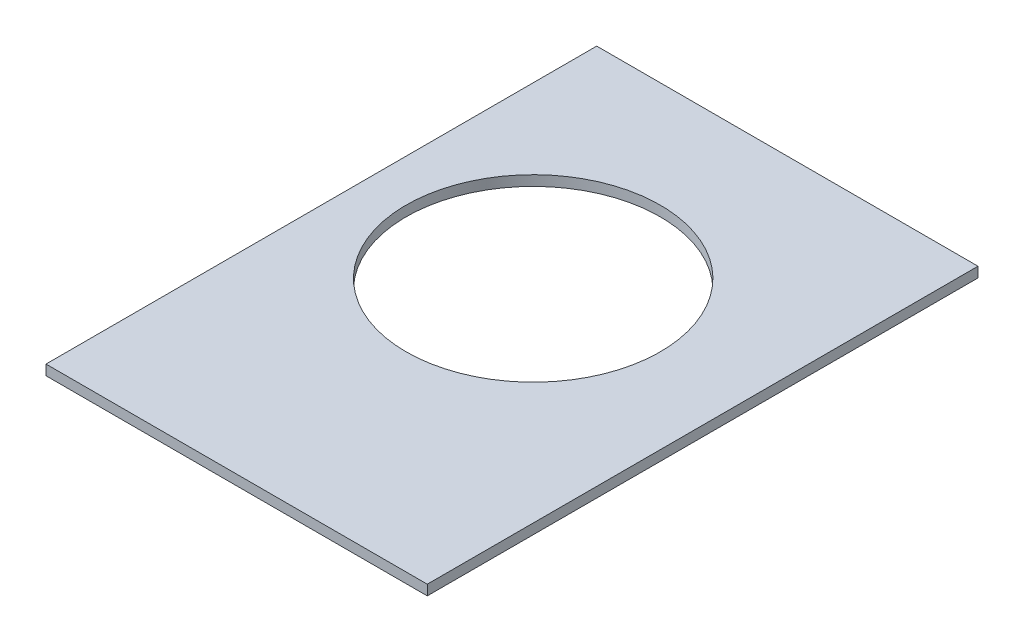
from build123d import *

# Parameters (mm, degrees)
SKETCH1_W               = 57.15
SKETCH1_H               = 82.55
BOSS_EXTRUDE1_DEPTH     = 1.524
CUT_EXTRUDE1_DEPTH      = 101.413881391
CUT_EXTRUDE1_DEPTH_BACK = 101.413881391
SKETCH2_R               = 19.05


with BuildPart() as part:
    # Sketch1 → Boss-Extrude1 (new body)
    with BuildSketch(Plane(origin=(0, 0, 0), x_dir=(1, 0, 0), z_dir=(0, 1, 0))):
        with Locations((28.575, 41.275)):
            Rectangle(SKETCH1_W, SKETCH1_H)
    extrude(amount=BOSS_EXTRUDE1_DEPTH)

    # Sketch2 → Cut-Extrude1 (cut, two sides: drawn at the far end of the back side and taken through both)
    with BuildSketch(Plane(origin=(0, 1.524, 0), x_dir=(1, 0, 0), z_dir=(0, 1, 0)).offset(-CUT_EXTRUDE1_DEPTH_BACK)):
        with Locations(Location((25.4, 47.625, 0), (0, 0, 270))):
            Circle(SKETCH2_R)
    extrude(amount=CUT_EXTRUDE1_DEPTH + CUT_EXTRUDE1_DEPTH_BACK, mode=Mode.SUBTRACT)


solid = part.part
